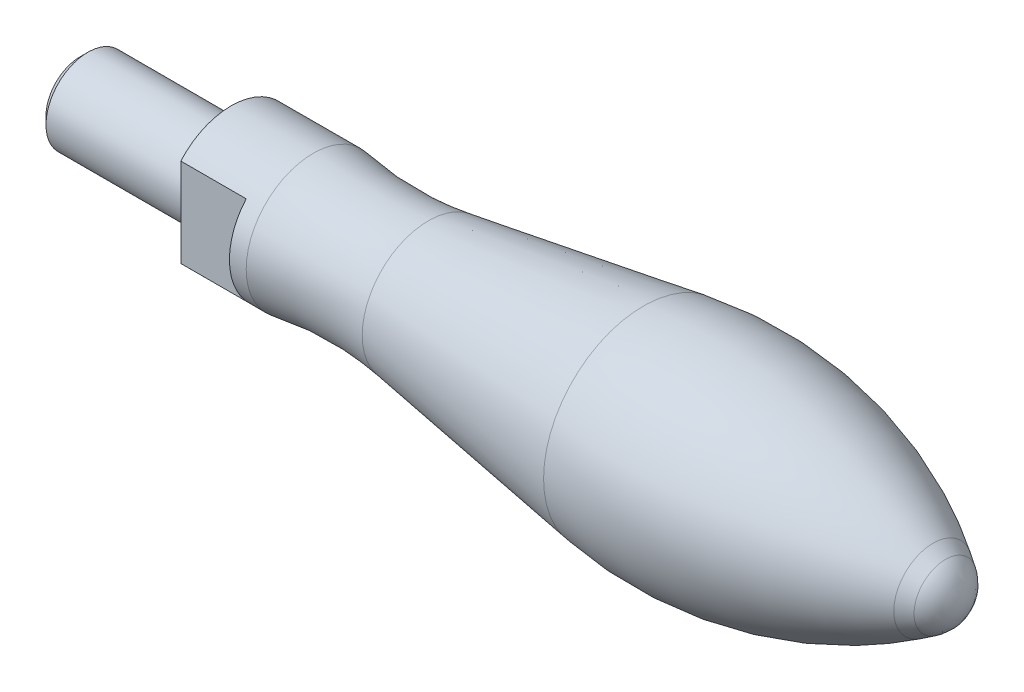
from build123d import *
from build123d.topology import SkipClean

# Parameters (mm, degrees)
CUT_EXTRUDE1_START = 7.8
SKETCH3_W          = 50
SKETCH3_H          = 50
CUT_EXTRUDE1_DEPTH = 7.8


with BuildPart() as part:
    # Sketch1 → Revolve1 (revolve)
    with BuildSketch(Plane.XY, mode=Mode.PRIVATE) as revolve1_sk:
        with BuildLine():
            Line((0, 0), (0, 8))
            Line((0, 8), (9.8, 8))
            ThreePointArc((9.8, 8), (16.662832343, 7.384074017), (23.534611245, 7.890519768))
            Line((23.534611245, 7.890519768), (49.175873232, 11.899775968))
            ThreePointArc((49.175873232, 11.899775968), (67.115369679, 11.445339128), (83.738995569, 4.686115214))
            Line((83.738995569, 4.686115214), (85.215509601, 3.746750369))
            ThreePointArc((85.215509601, 3.746750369), (86.732510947, 2.137546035), (87.299722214, 0))
            Line((87.299722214, 0), (0, 0))
        make_face()
    revolve(revolve1_sk.sketch.rotate(Axis((87.3, 0, 0), (-1, 0, 0)), 270), axis=Axis((87.3, 0, 0), (-1, 0, 0)))

    # Sketch2 → Revolve2 (revolve)
    with BuildSketch(Plane.XY, mode=Mode.PRIVATE) as revolve2_sk:
        Polygon((-18, 0), (-18, 4.08), (-17.08, 5), (0, 5), (0, 0), align=None)
    revolve(revolve2_sk.sketch.rotate(Axis((0, 0, 0), (-1, 0, 0)), 270), axis=Axis((0, 0, 0), (-1, 0, 0)))

    # Sketch3 → Cut-Extrude1 (cut)
    with SkipClean():  # the faces are left unmerged after this step: merging them gives an invalid solid
        with BuildSketch(Plane(origin=(0, 0, 0), x_dir=(0, 0, -1), z_dir=(1, 0, 0)).offset(CUT_EXTRUDE1_START)):
            Rectangle(SKETCH3_W, SKETCH3_H)
            with BuildLine():
                Line((6, -5.291502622), (6, 5.291502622))
                ThreePointArc((6, 5.291502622), (0, 8), (-6, 5.291502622))
                Line((-6, 5.291502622), (-6, -5.291502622))
                ThreePointArc((-6, -5.291502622), (0, -8), (6, -5.291502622))
            make_face(mode=Mode.SUBTRACT)
        extrude(amount=-CUT_EXTRUDE1_DEPTH, mode=Mode.SUBTRACT)


solid = part.part
